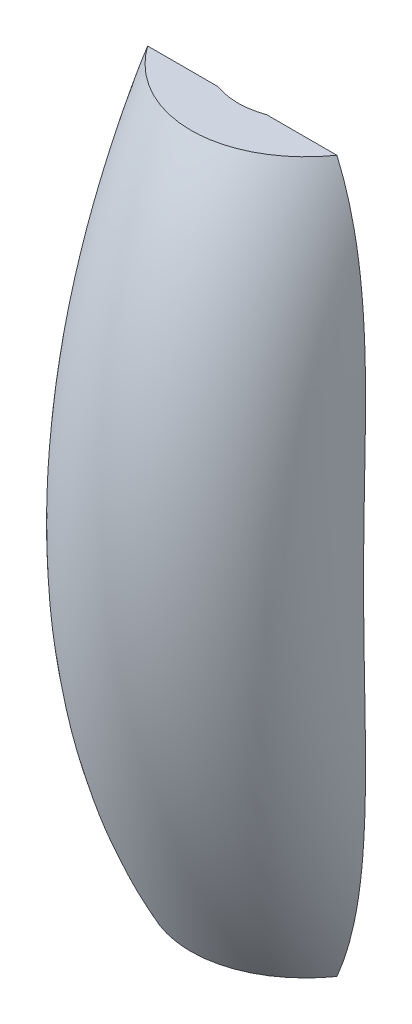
ISO-10303-21;
HEADER;
FILE_DESCRIPTION(('STEP AP214'),'2;1');
FILE_NAME('part.step','',(''),(''),'','','');
FILE_SCHEMA(('AUTOMOTIVE_DESIGN { 1 0 10303 214 1 1 1 1 }'));
ENDSEC;
DATA;
#1=APPLICATION_CONTEXT('core data for automotive mechanical design processes');
#2=APPLICATION_PROTOCOL_DEFINITION('international standard','automotive_design',2000,#1);
#3=PRODUCT_CONTEXT('',#1,'mechanical');
#4=PRODUCT('Part','Part','',(#3));
#5=PRODUCT_RELATED_PRODUCT_CATEGORY('part','',(#4));
#6=PRODUCT_DEFINITION_FORMATION('','',#4);
#7=PRODUCT_DEFINITION_CONTEXT('part definition',#1,'design');
#8=PRODUCT_DEFINITION('design','',#6,#7);
#9=PRODUCT_DEFINITION_SHAPE('','',#8);
#10=(LENGTH_UNIT() NAMED_UNIT(*) SI_UNIT(.MILLI.,.METRE.));
#11=(NAMED_UNIT(*) PLANE_ANGLE_UNIT() SI_UNIT($,.RADIAN.));
#12=(NAMED_UNIT(*) SI_UNIT($,.STERADIAN.) SOLID_ANGLE_UNIT());
#13=UNCERTAINTY_MEASURE_WITH_UNIT(LENGTH_MEASURE(1.E-05),#10,'distance_accuracy_value','');
#14=(GEOMETRIC_REPRESENTATION_CONTEXT(3) GLOBAL_UNCERTAINTY_ASSIGNED_CONTEXT((#13)) GLOBAL_UNIT_ASSIGNED_CONTEXT((#10,
#11,#12)) REPRESENTATION_CONTEXT('',''));
#15=CARTESIAN_POINT('',(0.,0.,0.));
#16=DIRECTION('',(0.,0.,1.));
#17=DIRECTION('',(1.,0.,0.));
#18=AXIS2_PLACEMENT_3D('',#15,#16,#17);
#19=CARTESIAN_POINT('',(0.,22.5,-133.));
#20=DIRECTION('',(1.,0.,0.));
#21=DIRECTION('',(0.,0.,-1.));
#22=AXIS2_PLACEMENT_3D('',#19,#20,#21);
#23=TOROIDAL_SURFACE('',#22,59.125,8.125);
#24=CARTESIAN_POINT('',(-2.39832928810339,-12.5,-76.));
#25=CARTESIAN_POINT('',(-2.53349893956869,-12.4201924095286,-76.));
#26=CARTESIAN_POINT('',(-2.6652676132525,-12.3348066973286,-76.));
#27=CARTESIAN_POINT('',(-2.92144714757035,-12.1545874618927,-76.));
#28=CARTESIAN_POINT('',(-3.04588402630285,-12.0597910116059,-76.));
#29=CARTESIAN_POINT('',(-3.2877487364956,-11.861932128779,-76.));
#30=CARTESIAN_POINT('',(-3.40518350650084,-11.7588781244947,-76.));
#31=CARTESIAN_POINT('',(-3.63171855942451,-11.5470693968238,-76.));
#32=CARTESIAN_POINT('',(-3.74091220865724,-11.4384141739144,-76.));
#33=CARTESIAN_POINT('',(-3.95304009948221,-11.2149861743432,-76.));
#34=CARTESIAN_POINT('',(-4.05596853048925,-11.1002078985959,-76.));
#35=CARTESIAN_POINT('',(-4.25575229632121,-10.8654179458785,-76.));
#36=CARTESIAN_POINT('',(-4.3526049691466,-10.7454040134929,-76.));
#37=CARTESIAN_POINT('',(-4.58534617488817,-10.4425136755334,-76.));
#38=CARTESIAN_POINT('',(-4.71779052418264,-10.2569851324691,-76.));
#39=CARTESIAN_POINT('',(-4.9708912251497,-9.87808621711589,-76.));
#40=CARTESIAN_POINT('',(-5.09154623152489,-9.68471495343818,-76.));
#41=CARTESIAN_POINT('',(-5.32200789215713,-9.29161483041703,-76.));
#42=CARTESIAN_POINT('',(-5.43181359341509,-9.09188541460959,-76.));
#43=CARTESIAN_POINT('',(-5.64214237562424,-8.68592338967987,-76.));
#44=CARTESIAN_POINT('',(-5.74259837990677,-8.47965619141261,-76.));
#45=CARTESIAN_POINT('',(-5.93420240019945,-8.06290696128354,-76.));
#46=CARTESIAN_POINT('',(-6.02535222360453,-7.85242575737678,-76.));
#47=CARTESIAN_POINT('',(-6.19911515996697,-7.42798367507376,-76.));
#48=CARTESIAN_POINT('',(-6.28172809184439,-7.21402272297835,-76.));
#49=CARTESIAN_POINT('',(-6.50667981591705,-6.59831422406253,-76.));
#50=CARTESIAN_POINT('',(-6.63940951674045,-6.19303750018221,-76.));
#51=CARTESIAN_POINT('',(-6.88170744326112,-5.3753306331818,-76.));
#52=CARTESIAN_POINT('',(-6.99125389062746,-4.96289415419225,-76.));
#53=CARTESIAN_POINT('',(-7.19034730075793,-4.13279433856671,-76.));
#54=CARTESIAN_POINT('',(-7.27987263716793,-3.7151258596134,-76.));
#55=CARTESIAN_POINT('',(-7.44149355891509,-2.87643605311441,-76.));
#56=CARTESIAN_POINT('',(-7.5135877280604,-2.4554144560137,-76.));
#57=CARTESIAN_POINT('',(-7.64314251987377,-1.60797814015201,-76.));
#58=CARTESIAN_POINT('',(-7.70049145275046,-1.18154653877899,-76.));
#59=CARTESIAN_POINT('',(-7.80188136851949,-0.327499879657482,-76.));
#60=CARTESIAN_POINT('',(-7.84593382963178,0.100113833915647,-76.));
#61=CARTESIAN_POINT('',(-7.92259723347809,0.956157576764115,-76.));
#62=CARTESIAN_POINT('',(-7.95521329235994,1.38458715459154,-76.));
#63=CARTESIAN_POINT('',(-8.01063643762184,2.24191132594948,-76.));
#64=CARTESIAN_POINT('',(-8.03344707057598,2.67080569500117,-76.));
#65=CARTESIAN_POINT('',(-8.07884913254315,3.71549719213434,-76.));
#66=CARTESIAN_POINT('',(-8.09703363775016,4.33148376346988,-76.));
#67=CARTESIAN_POINT('',(-8.12012292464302,5.56371913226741,-76.));
#68=CARTESIAN_POINT('',(-8.12502668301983,6.17996794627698,-76.));
#69=CARTESIAN_POINT('',(-8.12497310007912,7.41247575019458,-76.));
#70=CARTESIAN_POINT('',(-8.12001534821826,8.02873473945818,-76.));
#71=CARTESIAN_POINT('',(-8.10331848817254,9.261134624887,-76.));
#72=CARTESIAN_POINT('',(-8.09157954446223,9.87727552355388,-76.));
#73=CARTESIAN_POINT('',(-8.06408237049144,11.1100103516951,-76.));
#74=CARTESIAN_POINT('',(-8.04832057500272,11.7266041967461,-76.));
#75=CARTESIAN_POINT('',(-8.01526904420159,12.9597517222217,-76.));
#76=CARTESIAN_POINT('',(-7.99797930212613,13.5763054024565,-76.));
#77=CARTESIAN_POINT('',(-7.96403085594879,14.8100263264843,-76.));
#78=CARTESIAN_POINT('',(-7.94737277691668,15.4271935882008,-76.));
#79=CARTESIAN_POINT('',(-7.91653942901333,16.6615902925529,-76.));
#80=CARTESIAN_POINT('',(-7.90236415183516,17.2788197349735,-76.));
#81=CARTESIAN_POINT('',(-7.87792116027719,18.5140519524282,-76.));
#82=CARTESIAN_POINT('',(-7.86765785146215,19.1320548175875,-76.));
#83=CARTESIAN_POINT('',(-7.85205691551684,20.3681242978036,-76.));
#84=CARTESIAN_POINT('',(-7.84671928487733,20.9861909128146,-76.));
#85=CARTESIAN_POINT('',(-7.84147094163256,22.2233103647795,-76.));
#86=CARTESIAN_POINT('',(-7.84156869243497,22.842363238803,-76.));
#87=CARTESIAN_POINT('',(-7.84720311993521,24.0804435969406,-76.));
#88=CARTESIAN_POINT('',(-7.85273979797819,24.6994710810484,-76.));
#89=CARTESIAN_POINT('',(-7.86864943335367,25.9315664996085,-76.));
#90=CARTESIAN_POINT('',(-7.87897583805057,26.5446350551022,-76.));
#91=CARTESIAN_POINT('',(-7.90346041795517,27.7706943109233,-76.));
#92=CARTESIAN_POINT('',(-7.91761860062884,28.3836850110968,-76.));
#93=CARTESIAN_POINT('',(-7.94835396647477,29.6098702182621,-76.));
#94=CARTESIAN_POINT('',(-7.964932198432,30.2230646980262,-76.));
#95=CARTESIAN_POINT('',(-7.99869734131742,31.4494362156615,-76.));
#96=CARTESIAN_POINT('',(-8.01588425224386,32.0626132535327,-76.));
#97=CARTESIAN_POINT('',(-8.04869995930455,33.2881561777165,-76.));
#98=CARTESIAN_POINT('',(-8.06433089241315,33.9005220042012,-76.));
#99=CARTESIAN_POINT('',(-8.09162443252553,35.1253523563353,-76.));
#100=CARTESIAN_POINT('',(-8.1032870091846,35.7378168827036,-76.));
#101=CARTESIAN_POINT('',(-8.11989302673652,36.9609752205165,-76.));
#102=CARTESIAN_POINT('',(-8.12485689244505,37.57166872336,-76.));
#103=CARTESIAN_POINT('',(-8.1251370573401,38.7930625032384,-76.));
#104=CARTESIAN_POINT('',(-8.12045355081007,39.4037627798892,-76.));
#105=CARTESIAN_POINT('',(-8.09815147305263,40.6227871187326,-76.));
#106=CARTESIAN_POINT('',(-8.08057877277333,41.2311119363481,-76.));
#107=CARTESIAN_POINT('',(-8.0288548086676,42.447151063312,-76.));
#108=CARTESIAN_POINT('',(-7.99470203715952,43.0548653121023,-76.));
#109=CARTESIAN_POINT('',(-7.90563283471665,44.2684393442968,-76.));
#110=CARTESIAN_POINT('',(-7.85072900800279,44.8743000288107,-75.9999999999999));
#111=CARTESIAN_POINT('',(-7.71528639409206,46.0830982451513,-76.0000000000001));
#112=CARTESIAN_POINT('',(-7.63475495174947,46.6860365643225,-76.0000000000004));
#113=CARTESIAN_POINT('',(-7.49717639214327,47.5440344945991,-76.0000000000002));
#114=CARTESIAN_POINT('',(-7.45297105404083,47.8011762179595,-76.0000000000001));
#115=CARTESIAN_POINT('',(-7.35818615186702,48.3144610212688,-75.9999999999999));
#116=CARTESIAN_POINT('',(-7.30760253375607,48.570603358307,-76.));
#117=CARTESIAN_POINT('',(-7.19949113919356,49.0814837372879,-76.));
#118=CARTESIAN_POINT('',(-7.14196179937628,49.3362214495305,-76.));
#119=CARTESIAN_POINT('',(-7.01906470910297,49.8449387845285,-76.));
#120=CARTESIAN_POINT('',(-6.95366507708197,50.0989107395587,-76.));
#121=CARTESIAN_POINT('',(-6.81450790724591,50.6045246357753,-76.));
#122=CARTESIAN_POINT('',(-6.74075158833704,50.8561669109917,-76.));
#123=CARTESIAN_POINT('',(-6.58407212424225,51.3565795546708,-76.));
#124=CARTESIAN_POINT('',(-6.50114945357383,51.6053500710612,-76.));
#125=CARTESIAN_POINT('',(-6.32381348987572,52.1033133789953,-76.));
#126=CARTESIAN_POINT('',(-6.22923620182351,52.3524480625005,-76.));
#127=CARTESIAN_POINT('',(-6.02861562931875,52.8461148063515,-76.));
#128=CARTESIAN_POINT('',(-5.92257102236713,53.0906463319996,-76.));
#129=CARTESIAN_POINT('',(-5.69777352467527,53.5740074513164,-76.));
#130=CARTESIAN_POINT('',(-5.57901306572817,53.8128335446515,-76.));
#131=CARTESIAN_POINT('',(-5.32874686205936,54.2807522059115,-76.));
#132=CARTESIAN_POINT('',(-5.19737751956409,54.5099172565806,-76.));
#133=CARTESIAN_POINT('',(-4.91960412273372,54.9588516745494,-76.));
#134=CARTESIAN_POINT('',(-4.77320693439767,55.1786252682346,-76.));
#135=CARTESIAN_POINT('',(-4.46396268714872,55.6061027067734,-76.));
#136=CARTESIAN_POINT('',(-4.30113223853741,55.8138184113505,-76.));
#137=CARTESIAN_POINT('',(-4.04689967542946,56.109820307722,-76.));
#138=CARTESIAN_POINT('',(-3.96237339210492,56.2040541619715,-76.));
#139=CARTESIAN_POINT('',(-3.78906705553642,56.3884820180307,-76.));
#140=CARTESIAN_POINT('',(-3.70028850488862,56.4786774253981,-76.));
#141=CARTESIAN_POINT('',(-3.51839357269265,56.6544784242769,-76.));
#142=CARTESIAN_POINT('',(-3.4252798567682,56.740086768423,-76.));
#143=CARTESIAN_POINT('',(-3.23343929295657,56.9071779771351,-76.));
#144=CARTESIAN_POINT('',(-3.13465858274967,56.9885991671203,-76.));
#145=CARTESIAN_POINT('',(-2.93241151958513,57.1455734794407,-76.));
#146=CARTESIAN_POINT('',(-2.8289419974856,57.221122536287,-76.));
#147=CARTESIAN_POINT('',(-2.61718541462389,57.3657065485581,-76.));
#148=CARTESIAN_POINT('',(-2.50888724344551,57.434725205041,-76.));
#149=CARTESIAN_POINT('',(-2.39832928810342,57.5,-76.));
#150=B_SPLINE_CURVE_WITH_KNOTS('',3,(#24,#25,#26,#27,#28,#29,#30,#31,#32,#33,#34,#35,#36,#37,
#38,#39,#40,#41,#42,#43,#44,#45,#46,#47,#48,#49,#50,#51,#52,#53,#54,#55,#56,#57,#58,#59,#60,#61,
#62,#63,#64,#65,#66,#67,#68,#69,#70,#71,#72,#73,#74,#75,#76,#77,#78,#79,#80,#81,#82,#83,#84,#85,
#86,#87,#88,#89,#90,#91,#92,#93,#94,#95,#96,#97,#98,#99,#100,#101,#102,#103,#104,#105,#106,#107,
#108,#109,#110,#111,#112,#113,#114,#115,#116,#117,#118,#119,#120,#121,#122,#123,#124,#125,#126,
#127,#128,#129,#130,#131,#132,#133,#134,#135,#136,#137,#138,#139,#140,#141,#142,#143,#144,#145,
#146,#147,#148,#149),.UNSPECIFIED.,.F.,.F.,(4,2,2,2,2,2,2,2,2,2,2,2,2,2,2,2,2,2,2,2,2,2,2,2,2,2,
2,2,2,2,2,2,2,2,2,2,2,2,2,2,2,2,2,2,2,2,2,2,2,2,2,2,2,2,2,2,2,2,2,2,2,2,4),(0.,
0.470644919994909,0.939504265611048,1.40789101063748,1.86974808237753,2.33202716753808,
2.79450739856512,3.47782879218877,4.16122806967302,4.8446873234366,5.53272282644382,
6.22062444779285,6.90854065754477,8.18700087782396,9.46665680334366,10.747688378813,
12.0288239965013,13.3193954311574,14.608849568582,15.8977261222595,17.1861361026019,
19.0346979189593,20.8834021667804,22.7321833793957,24.580919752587,26.4313002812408,
28.2816890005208,30.1338633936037,31.9860315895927,33.8402795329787,35.6945261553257,
37.5516600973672,39.4087944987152,41.248245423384,43.0876999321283,44.9279539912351,
46.7682080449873,48.6058987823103,50.4436035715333,52.2756923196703,54.1077441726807,
55.9333074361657,57.7590367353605,59.5836588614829,61.4077585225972,62.1904364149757,
62.9736143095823,63.7569688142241,64.5436107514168,65.3301380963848,66.116624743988,
66.915817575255,67.7151026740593,68.5148661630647,69.3067870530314,70.0983477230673,
70.8891161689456,71.2687721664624,71.6482949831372,72.027587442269,72.4114216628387,
72.7955193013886,73.1805516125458),.UNSPECIFIED.);
#151=CARTESIAN_POINT('',(-2.39832928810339,-12.5,-76.));
#152=VERTEX_POINT('',#151);
#153=CARTESIAN_POINT('',(-2.39832928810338,57.5,-76.));
#154=VERTEX_POINT('',#153);
#155=EDGE_CURVE('E21',#152,#154,#150,.T.);
#156=ORIENTED_EDGE('',*,*,#155,.T.);
#157=CARTESIAN_POINT('',(0.,57.5,-75.5755931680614));
#158=CARTESIAN_POINT('',(-0.0821959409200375,57.5,-75.5755920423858));
#159=CARTESIAN_POINT('',(-0.16439169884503,57.5,-75.5770538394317));
#160=CARTESIAN_POINT('',(-0.328279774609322,57.5,-75.5828809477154));
#161=CARTESIAN_POINT('',(-0.409972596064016,57.5,-75.5872320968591));
#162=CARTESIAN_POINT('',(-0.572858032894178,57.5,-75.5987948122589));
#163=CARTESIAN_POINT('',(-0.654051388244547,57.5,-75.6059959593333));
#164=CARTESIAN_POINT('',(-0.815940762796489,57.5,-75.6232225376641));
#165=CARTESIAN_POINT('',(-0.89663750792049,57.5,-75.6332411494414));
#166=CARTESIAN_POINT('',(-1.05753601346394,57.5,-75.6560752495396));
#167=CARTESIAN_POINT('',(-1.13773824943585,57.5,-75.6688873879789));
#168=CARTESIAN_POINT('',(-1.29764256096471,57.5,-75.6972877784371));
#169=CARTESIAN_POINT('',(-1.3773446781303,57.5,-75.7128757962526));
#170=CARTESIAN_POINT('',(-1.53626144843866,57.5,-75.7468180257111));
#171=CARTESIAN_POINT('',(-1.61547536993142,57.5,-75.7651756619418));
#172=CARTESIAN_POINT('',(-1.77341674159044,57.5,-75.8046537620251));
#173=CARTESIAN_POINT('',(-1.85214253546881,57.5,-75.8257808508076));
#174=CARTESIAN_POINT('',(-2.00910659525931,57.5,-75.8708023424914));
#175=CARTESIAN_POINT('',(-2.0873420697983,57.5,-75.8947064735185));
#176=CARTESIAN_POINT('',(-2.24332363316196,57.5,-75.9452928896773));
#177=CARTESIAN_POINT('',(-2.32106558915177,57.5,-75.9719879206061));
#178=CARTESIAN_POINT('',(-2.39832928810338,57.5,-76.));
#179=B_SPLINE_CURVE_WITH_KNOTS('',3,(#157,#158,#159,#160,#161,#162,#163,#164,#165,#166,#167,
#168,#169,#170,#171,#172,#173,#174,#175,#176,#177,#178),.UNSPECIFIED.,.F.,.F.,(4,2,2,2,2,2,2,2,
2,2,4),(0.,0.246574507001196,0.491949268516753,0.736435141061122,0.980334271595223,
1.22394252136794,1.46753022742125,1.71142163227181,1.95590748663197,2.20127719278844,
2.44782095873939),.UNSPECIFIED.);
#180=CARTESIAN_POINT('',(0.,57.5,-75.5755931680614));
#181=VERTEX_POINT('',#180);
#182=EDGE_CURVE('E126',#181,#154,#179,.T.);
#183=ORIENTED_EDGE('',*,*,#182,.F.);
#184=CARTESIAN_POINT('',(2.39832928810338,57.5,-76.));
#185=CARTESIAN_POINT('',(2.32106558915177,57.5,-75.9719879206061));
#186=CARTESIAN_POINT('',(2.24332363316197,57.5,-75.9452928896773));
#187=CARTESIAN_POINT('',(2.08734206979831,57.5,-75.8947064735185));
#188=CARTESIAN_POINT('',(2.00910659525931,57.5,-75.8708023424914));
#189=CARTESIAN_POINT('',(1.85214253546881,57.5,-75.8257808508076));
#190=CARTESIAN_POINT('',(1.77341674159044,57.5,-75.8046537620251));
#191=CARTESIAN_POINT('',(1.61547536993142,57.5,-75.7651756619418));
#192=CARTESIAN_POINT('',(1.53626144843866,57.5,-75.7468180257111));
#193=CARTESIAN_POINT('',(1.3773446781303,57.5,-75.7128757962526));
#194=CARTESIAN_POINT('',(1.29764256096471,57.5,-75.6972877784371));
#195=CARTESIAN_POINT('',(1.13773824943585,57.5,-75.6688873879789));
#196=CARTESIAN_POINT('',(1.05753601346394,57.5,-75.6560752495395));
#197=CARTESIAN_POINT('',(0.896637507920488,57.5,-75.6332411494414));
#198=CARTESIAN_POINT('',(0.815940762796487,57.5,-75.623222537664));
#199=CARTESIAN_POINT('',(0.654051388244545,57.5,-75.6059959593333));
#200=CARTESIAN_POINT('',(0.572858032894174,57.5,-75.5987948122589));
#201=CARTESIAN_POINT('',(0.409972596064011,57.5,-75.5872320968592));
#202=CARTESIAN_POINT('',(0.328279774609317,57.5,-75.5828809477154));
#203=CARTESIAN_POINT('',(0.164391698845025,57.5,-75.5770538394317));
#204=CARTESIAN_POINT('',(0.0821959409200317,57.5,-75.5755920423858));
#205=CARTESIAN_POINT('',(0.,57.5,-75.5755931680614));
#206=B_SPLINE_CURVE_WITH_KNOTS('',3,(#184,#185,#186,#187,#188,#189,#190,#191,#192,#193,#194,
#195,#196,#197,#198,#199,#200,#201,#202,#203,#204,#205),.UNSPECIFIED.,.F.,.F.,(4,2,2,2,2,2,2,2,
2,2,4),(0.,0.246543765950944,0.49191347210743,0.736399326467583,0.980290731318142,
1.22387843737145,1.46748668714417,1.71138581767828,1.95587169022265,2.2012464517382,
2.4478209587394),.UNSPECIFIED.);
#207=CARTESIAN_POINT('',(2.39832928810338,57.5,-76.));
#208=VERTEX_POINT('',#207);
#209=EDGE_CURVE('E177',#208,#181,#206,.T.);
#210=ORIENTED_EDGE('',*,*,#209,.F.);
#211=CARTESIAN_POINT('',(2.39832928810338,57.5,-76.));
#212=CARTESIAN_POINT('',(2.5334989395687,57.4201924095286,-76.));
#213=CARTESIAN_POINT('',(2.6652676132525,57.3348066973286,-76.));
#214=CARTESIAN_POINT('',(2.92144714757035,57.1545874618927,-76.));
#215=CARTESIAN_POINT('',(3.04588402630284,57.0597910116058,-76.));
#216=CARTESIAN_POINT('',(3.28774873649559,56.861932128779,-76.));
#217=CARTESIAN_POINT('',(3.40518350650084,56.7588781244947,-76.));
#218=CARTESIAN_POINT('',(3.63171855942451,56.5470693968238,-76.));
#219=CARTESIAN_POINT('',(3.74091220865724,56.4384141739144,-76.));
#220=CARTESIAN_POINT('',(3.95304009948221,56.2149861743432,-76.));
#221=CARTESIAN_POINT('',(4.05596853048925,56.1002078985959,-76.));
#222=CARTESIAN_POINT('',(4.2557522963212,55.8654179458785,-76.));
#223=CARTESIAN_POINT('',(4.35260496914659,55.7454040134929,-76.));
#224=CARTESIAN_POINT('',(4.58534617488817,55.4425136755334,-76.));
#225=CARTESIAN_POINT('',(4.71779052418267,55.2569851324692,-76.));
#226=CARTESIAN_POINT('',(4.97089122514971,54.8780862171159,-76.));
#227=CARTESIAN_POINT('',(5.09154623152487,54.6847149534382,-76.));
#228=CARTESIAN_POINT('',(5.32200789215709,54.291614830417,-76.));
#229=CARTESIAN_POINT('',(5.43181359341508,54.0918854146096,-76.));
#230=CARTESIAN_POINT('',(5.64214237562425,53.6859233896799,-76.));
#231=CARTESIAN_POINT('',(5.74259837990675,53.4796561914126,-76.));
#232=CARTESIAN_POINT('',(5.93420240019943,53.0629069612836,-76.));
#233=CARTESIAN_POINT('',(6.02535222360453,52.8524257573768,-76.));
#234=CARTESIAN_POINT('',(6.19911515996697,52.4279836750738,-76.));
#235=CARTESIAN_POINT('',(6.28172809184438,52.2140227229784,-76.));
#236=CARTESIAN_POINT('',(6.50667981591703,51.5983142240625,-76.));
#237=CARTESIAN_POINT('',(6.63940951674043,51.1930375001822,-76.));
#238=CARTESIAN_POINT('',(6.88170744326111,50.3753306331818,-76.));
#239=CARTESIAN_POINT('',(6.99125389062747,49.9628941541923,-76.));
#240=CARTESIAN_POINT('',(7.19034730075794,49.1327943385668,-76.));
#241=CARTESIAN_POINT('',(7.27987263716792,48.7151258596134,-76.));
#242=CARTESIAN_POINT('',(7.44149355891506,47.8764360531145,-76.));
#243=CARTESIAN_POINT('',(7.51358772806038,47.4554144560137,-76.));
#244=CARTESIAN_POINT('',(7.64314251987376,46.6079781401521,-76.));
#245=CARTESIAN_POINT('',(7.70049145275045,46.181546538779,-76.));
#246=CARTESIAN_POINT('',(7.80188136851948,45.3274998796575,-76.));
#247=CARTESIAN_POINT('',(7.84593382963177,44.8998861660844,-76.));
#248=CARTESIAN_POINT('',(7.92259723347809,44.0438424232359,-76.));
#249=CARTESIAN_POINT('',(7.95521329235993,43.6154128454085,-76.));
#250=CARTESIAN_POINT('',(8.01063643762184,42.7580886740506,-76.));
#251=CARTESIAN_POINT('',(8.03344707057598,42.3291943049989,-76.));
#252=CARTESIAN_POINT('',(8.07884913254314,41.2845028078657,-76.));
#253=CARTESIAN_POINT('',(8.09703363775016,40.6685162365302,-76.));
#254=CARTESIAN_POINT('',(8.12012292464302,39.4362808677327,-76.));
#255=CARTESIAN_POINT('',(8.12502668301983,38.8200320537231,-76.));
#256=CARTESIAN_POINT('',(8.12497310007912,37.5875242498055,-76.));
#257=CARTESIAN_POINT('',(8.12001534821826,36.9712652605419,-76.));
#258=CARTESIAN_POINT('',(8.10331848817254,35.7388653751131,-76.));
#259=CARTESIAN_POINT('',(8.09157954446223,35.1227244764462,-76.));
#260=CARTESIAN_POINT('',(8.06408237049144,33.889989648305,-76.));
#261=CARTESIAN_POINT('',(8.04832057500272,33.2733958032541,-76.));
#262=CARTESIAN_POINT('',(8.0152690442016,32.0402482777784,-76.));
#263=CARTESIAN_POINT('',(7.99797930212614,31.4236945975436,-76.));
#264=CARTESIAN_POINT('',(7.9640308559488,30.1899736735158,-76.));
#265=CARTESIAN_POINT('',(7.94737277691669,29.5728064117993,-76.));
#266=CARTESIAN_POINT('',(7.91653942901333,28.3384097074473,-76.));
#267=CARTESIAN_POINT('',(7.90236415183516,27.7211802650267,-76.));
#268=CARTESIAN_POINT('',(7.8779211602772,26.4859480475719,-76.));
#269=CARTESIAN_POINT('',(7.86765785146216,25.8679451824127,-76.));
#270=CARTESIAN_POINT('',(7.85205691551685,24.6318757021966,-76.));
#271=CARTESIAN_POINT('',(7.84671928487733,24.0138090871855,-76.));
#272=CARTESIAN_POINT('',(7.84147094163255,22.7766896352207,-76.));
#273=CARTESIAN_POINT('',(7.84156869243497,22.1576367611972,-76.));
#274=CARTESIAN_POINT('',(7.84720311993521,20.9195564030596,-76.));
#275=CARTESIAN_POINT('',(7.8527397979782,20.3005289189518,-76.));
#276=CARTESIAN_POINT('',(7.86864943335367,19.0684335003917,-76.));
#277=CARTESIAN_POINT('',(7.87897583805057,18.4553649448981,-76.));
#278=CARTESIAN_POINT('',(7.90346041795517,17.2293056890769,-76.));
#279=CARTESIAN_POINT('',(7.91761860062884,16.6163149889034,-76.));
#280=CARTESIAN_POINT('',(7.94835396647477,15.3901297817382,-76.));
#281=CARTESIAN_POINT('',(7.96493219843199,14.776935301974,-76.));
#282=CARTESIAN_POINT('',(7.99869734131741,13.5505637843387,-76.));
#283=CARTESIAN_POINT('',(8.01588425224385,12.9373867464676,-76.));
#284=CARTESIAN_POINT('',(8.04869995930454,11.7118438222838,-76.));
#285=CARTESIAN_POINT('',(8.06433089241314,11.0994779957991,-76.));
#286=CARTESIAN_POINT('',(8.09162443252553,9.87464764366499,-76.));
#287=CARTESIAN_POINT('',(8.10328700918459,9.26218311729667,-76.));
#288=CARTESIAN_POINT('',(8.11989302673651,8.03902477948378,-76.));
#289=CARTESIAN_POINT('',(8.12485689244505,7.42833127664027,-76.));
#290=CARTESIAN_POINT('',(8.1251370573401,6.20693749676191,-76.));
#291=CARTESIAN_POINT('',(8.12045355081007,5.59623722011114,-76.));
#292=CARTESIAN_POINT('',(8.09815147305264,4.37721288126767,-76.));
#293=CARTESIAN_POINT('',(8.08057877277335,3.76888806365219,-76.));
#294=CARTESIAN_POINT('',(8.02885480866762,2.55284893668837,-76.));
#295=CARTESIAN_POINT('',(7.99470203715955,1.94513468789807,-76.));
#296=CARTESIAN_POINT('',(7.90563283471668,0.731560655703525,-76.));
#297=CARTESIAN_POINT('',(7.85072900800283,0.125699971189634,-75.9999999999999));
#298=CARTESIAN_POINT('',(7.71528639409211,-1.08309824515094,-76.0000000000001));
#299=CARTESIAN_POINT('',(7.63475495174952,-1.68603656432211,-76.0000000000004));
#300=CARTESIAN_POINT('',(7.49717639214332,-2.54403449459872,-76.0000000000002));
#301=CARTESIAN_POINT('',(7.45297105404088,-2.80117621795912,-76.0000000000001));
#302=CARTESIAN_POINT('',(7.35818615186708,-3.31446102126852,-75.9999999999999));
#303=CARTESIAN_POINT('',(7.30760253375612,-3.57060335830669,-76.));
#304=CARTESIAN_POINT('',(7.19949113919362,-4.08148373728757,-76.));
#305=CARTESIAN_POINT('',(7.14196179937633,-4.3362214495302,-76.));
#306=CARTESIAN_POINT('',(7.01906470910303,-4.84493878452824,-76.));
#307=CARTESIAN_POINT('',(6.95366507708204,-5.09891073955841,-76.));
#308=CARTESIAN_POINT('',(6.81450790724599,-5.60452463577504,-76.));
#309=CARTESIAN_POINT('',(6.74075158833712,-5.85616691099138,-76.));
#310=CARTESIAN_POINT('',(6.58407212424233,-6.35657955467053,-76.));
#311=CARTESIAN_POINT('',(6.50114945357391,-6.60535007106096,-76.));
#312=CARTESIAN_POINT('',(6.32381348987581,-7.10331337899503,-76.));
#313=CARTESIAN_POINT('',(6.22923620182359,-7.35244806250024,-76.));
#314=CARTESIAN_POINT('',(6.02861562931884,-7.84611480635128,-76.));
#315=CARTESIAN_POINT('',(5.92257102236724,-8.0906463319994,-76.));
#316=CARTESIAN_POINT('',(5.69777352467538,-8.5740074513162,-76.));
#317=CARTESIAN_POINT('',(5.57901306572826,-8.81283354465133,-76.));
#318=CARTESIAN_POINT('',(5.32874686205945,-9.28075220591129,-76.));
#319=CARTESIAN_POINT('',(5.19737751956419,-9.50991725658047,-76.));
#320=CARTESIAN_POINT('',(4.91960412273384,-9.95885167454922,-76.));
#321=CARTESIAN_POINT('',(4.77320693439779,-10.1786252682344,-76.));
#322=CARTESIAN_POINT('',(4.46396268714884,-10.6061027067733,-76.));
#323=CARTESIAN_POINT('',(4.30113223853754,-10.8138184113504,-76.));
#324=CARTESIAN_POINT('',(4.04689967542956,-11.1098203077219,-76.));
#325=CARTESIAN_POINT('',(3.962373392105,-11.2040541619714,-76.));
#326=CARTESIAN_POINT('',(3.78906705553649,-11.3884820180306,-76.));
#327=CARTESIAN_POINT('',(3.70028850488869,-11.478677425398,-76.));
#328=CARTESIAN_POINT('',(3.51839357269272,-11.6544784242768,-76.));
#329=CARTESIAN_POINT('',(3.42527985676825,-11.7400867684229,-76.));
#330=CARTESIAN_POINT('',(3.23343929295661,-11.9071779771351,-76.));
#331=CARTESIAN_POINT('',(3.13465858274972,-11.9885991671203,-76.));
#332=CARTESIAN_POINT('',(2.93241151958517,-12.1455734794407,-76.));
#333=CARTESIAN_POINT('',(2.82894199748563,-12.221122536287,-76.));
#334=CARTESIAN_POINT('',(2.61718541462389,-12.3657065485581,-76.));
#335=CARTESIAN_POINT('',(2.50888724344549,-12.4347252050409,-76.));
#336=CARTESIAN_POINT('',(2.3983292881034,-12.5,-76.));
#337=B_SPLINE_CURVE_WITH_KNOTS('',3,(#211,#212,#213,#214,#215,#216,#217,#218,#219,#220,#221,
#222,#223,#224,#225,#226,#227,#228,#229,#230,#231,#232,#233,#234,#235,#236,#237,#238,#239,#240,
#241,#242,#243,#244,#245,#246,#247,#248,#249,#250,#251,#252,#253,#254,#255,#256,#257,#258,#259,
#260,#261,#262,#263,#264,#265,#266,#267,#268,#269,#270,#271,#272,#273,#274,#275,#276,#277,#278,
#279,#280,#281,#282,#283,#284,#285,#286,#287,#288,#289,#290,#291,#292,#293,#294,#295,#296,#297,
#298,#299,#300,#301,#302,#303,#304,#305,#306,#307,#308,#309,#310,#311,#312,#313,#314,#315,#316,
#317,#318,#319,#320,#321,#322,#323,#324,#325,#326,#327,#328,#329,#330,#331,#332,#333,#334,#335,
#336),.UNSPECIFIED.,.F.,.F.,(4,2,2,2,2,2,2,2,2,2,2,2,2,2,2,2,2,2,2,2,2,2,2,2,2,2,2,2,2,2,2,2,2,
2,2,2,2,2,2,2,2,2,2,2,2,2,2,2,2,2,2,2,2,2,2,2,2,2,2,2,2,2,4),(0.,0.470644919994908,
0.93950426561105,1.40789101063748,1.86974808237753,2.33202716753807,2.7945073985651,
3.47782879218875,4.16122806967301,4.84468732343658,5.53272282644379,6.22062444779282,
6.90854065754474,8.18700087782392,9.46665680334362,10.7476883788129,12.0288239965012,
13.3193954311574,14.6088495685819,15.8977261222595,17.1861361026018,19.0346979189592,
20.8834021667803,22.7321833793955,24.5809197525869,26.4313002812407,28.2816890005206,
30.1338633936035,31.9860315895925,33.8402795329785,35.6945261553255,37.551660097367,
39.408794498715,41.2482454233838,43.087699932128,44.9279539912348,46.768208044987,
48.60589878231,50.443603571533,52.27569231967,54.1077441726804,55.9333074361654,
57.7590367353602,59.5836588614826,61.4077585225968,62.1904364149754,62.973614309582,
63.7569688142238,64.5436107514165,65.3301380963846,66.1166247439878,66.9158175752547,
67.7151026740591,68.5148661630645,69.3067870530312,70.0983477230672,70.8891161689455,
71.2687721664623,71.6482949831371,72.027587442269,72.4114216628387,72.7955193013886,
73.1805516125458),.UNSPECIFIED.);
#338=CARTESIAN_POINT('',(2.39832928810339,-12.5,-76.));
#339=VERTEX_POINT('',#338);
#340=EDGE_CURVE('E97',#208,#339,#337,.T.);
#341=ORIENTED_EDGE('',*,*,#340,.T.);
#342=CARTESIAN_POINT('',(0.,-12.5,-75.5755931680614));
#343=CARTESIAN_POINT('',(0.0821959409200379,-12.5,-75.5755920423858));
#344=CARTESIAN_POINT('',(0.16439169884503,-12.5,-75.5770538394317));
#345=CARTESIAN_POINT('',(0.328279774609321,-12.5,-75.5828809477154));
#346=CARTESIAN_POINT('',(0.409972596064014,-12.5,-75.5872320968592));
#347=CARTESIAN_POINT('',(0.572858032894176,-12.5,-75.5987948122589));
#348=CARTESIAN_POINT('',(0.654051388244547,-12.5,-75.6059959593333));
#349=CARTESIAN_POINT('',(0.81594076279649,-12.5,-75.623222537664));
#350=CARTESIAN_POINT('',(0.896637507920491,-12.5,-75.6332411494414));
#351=CARTESIAN_POINT('',(1.05753601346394,-12.5,-75.6560752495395));
#352=CARTESIAN_POINT('',(1.13773824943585,-12.5,-75.6688873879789));
#353=CARTESIAN_POINT('',(1.29764256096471,-12.5,-75.6972877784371));
#354=CARTESIAN_POINT('',(1.37734467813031,-12.5,-75.7128757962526));
#355=CARTESIAN_POINT('',(1.53626144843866,-12.5,-75.7468180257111));
#356=CARTESIAN_POINT('',(1.61547536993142,-12.5,-75.7651756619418));
#357=CARTESIAN_POINT('',(1.77341674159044,-12.5,-75.8046537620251));
#358=CARTESIAN_POINT('',(1.85214253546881,-12.5,-75.8257808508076));
#359=CARTESIAN_POINT('',(2.00910659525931,-12.5,-75.8708023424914));
#360=CARTESIAN_POINT('',(2.0873420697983,-12.5,-75.8947064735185));
#361=CARTESIAN_POINT('',(2.24332363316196,-12.5,-75.9452928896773));
#362=CARTESIAN_POINT('',(2.32106558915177,-12.5,-75.9719879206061));
#363=CARTESIAN_POINT('',(2.39832928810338,-12.5,-76.));
#364=B_SPLINE_CURVE_WITH_KNOTS('',3,(#342,#343,#344,#345,#346,#347,#348,#349,#350,#351,#352,
#353,#354,#355,#356,#357,#358,#359,#360,#361,#362,#363),.UNSPECIFIED.,.F.,.F.,(4,2,2,2,2,2,2,2,
2,2,4),(0.,0.246574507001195,0.491949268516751,0.736435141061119,0.980334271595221,
1.22394252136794,1.46753022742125,1.71142163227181,1.95590748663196,2.20127719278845,
2.44782095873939),.UNSPECIFIED.);
#365=CARTESIAN_POINT('',(0.,-12.5,-75.5755931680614));
#366=VERTEX_POINT('',#365);
#367=EDGE_CURVE('E81',#366,#339,#364,.T.);
#368=ORIENTED_EDGE('',*,*,#367,.F.);
#369=CARTESIAN_POINT('',(-2.39832928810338,-12.5,-76.));
#370=CARTESIAN_POINT('',(-2.32106558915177,-12.5,-75.9719879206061));
#371=CARTESIAN_POINT('',(-2.24332363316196,-12.5,-75.9452928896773));
#372=CARTESIAN_POINT('',(-2.0873420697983,-12.5,-75.8947064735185));
#373=CARTESIAN_POINT('',(-2.00910659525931,-12.5,-75.8708023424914));
#374=CARTESIAN_POINT('',(-1.85214253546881,-12.5,-75.8257808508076));
#375=CARTESIAN_POINT('',(-1.77341674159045,-12.5,-75.8046537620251));
#376=CARTESIAN_POINT('',(-1.61547536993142,-12.5,-75.7651756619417));
#377=CARTESIAN_POINT('',(-1.53626144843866,-12.5,-75.7468180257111));
#378=CARTESIAN_POINT('',(-1.37734467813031,-12.5,-75.7128757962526));
#379=CARTESIAN_POINT('',(-1.29764256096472,-12.5,-75.6972877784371));
#380=CARTESIAN_POINT('',(-1.13773824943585,-12.5,-75.6688873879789));
#381=CARTESIAN_POINT('',(-1.05753601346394,-12.5,-75.6560752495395));
#382=CARTESIAN_POINT('',(-0.896637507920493,-12.5,-75.6332411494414));
#383=CARTESIAN_POINT('',(-0.815940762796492,-12.5,-75.623222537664));
#384=CARTESIAN_POINT('',(-0.65405138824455,-12.5,-75.6059959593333));
#385=CARTESIAN_POINT('',(-0.57285803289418,-12.5,-75.5987948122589));
#386=CARTESIAN_POINT('',(-0.409972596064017,-12.5,-75.5872320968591));
#387=CARTESIAN_POINT('',(-0.328279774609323,-12.5,-75.5828809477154));
#388=CARTESIAN_POINT('',(-0.16439169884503,-12.5,-75.5770538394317));
#389=CARTESIAN_POINT('',(-0.0821959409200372,-12.5,-75.5755920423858));
#390=CARTESIAN_POINT('',(0.,-12.5,-75.5755931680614));
#391=B_SPLINE_CURVE_WITH_KNOTS('',3,(#369,#370,#371,#372,#373,#374,#375,#376,#377,#378,#379,
#380,#381,#382,#383,#384,#385,#386,#387,#388,#389,#390),.UNSPECIFIED.,.F.,.F.,(4,2,2,2,2,2,2,2,
2,2,4),(0.,0.246543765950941,0.491913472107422,0.736399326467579,0.980290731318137,
1.22387843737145,1.46748668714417,1.71138581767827,1.95587169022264,2.2012464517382,
2.44782095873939),.UNSPECIFIED.);
#392=EDGE_CURVE('E77',#152,#366,#391,.T.);
#393=ORIENTED_EDGE('',*,*,#392,.F.);
#394=EDGE_LOOP('',(#156,#183,#210,#341,#368,#393));
#395=FACE_BOUND('',#394,.T.);
#396=ADVANCED_FACE('F16',(#395),#23,.F.);
#397=CARTESIAN_POINT('',(-15.,22.5,-76.));
#398=DIRECTION('',(0.,0.,1.));
#399=DIRECTION('',(1.,0.,0.));
#400=AXIS2_PLACEMENT_3D('',#397,#398,#399);
#401=PLANE('',#400);
#402=DIRECTION('',(1.,0.,0.));
#403=VECTOR('',#402,1.);
#404=CARTESIAN_POINT('',(0.,-12.5,-76.0000000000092));
#405=LINE('',#404,#403);
#406=CARTESIAN_POINT('',(-9.31407447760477,-12.5,-76.0000000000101));
#407=VERTEX_POINT('',#406);
#408=EDGE_CURVE('E86',#407,#152,#405,.T.);
#409=ORIENTED_EDGE('',*,*,#408,.F.);
#410=CARTESIAN_POINT('',(-11.9373363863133,22.5,-76.));
#411=CARTESIAN_POINT('',(-11.9373325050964,22.1612295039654,-76.));
#412=CARTESIAN_POINT('',(-11.9378745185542,21.8224592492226,-76.));
#413=CARTESIAN_POINT('',(-11.9400166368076,21.1449226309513,-76.));
#414=CARTESIAN_POINT('',(-11.9416167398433,20.8061562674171,-76.));
#415=CARTESIAN_POINT('',(-11.9479599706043,19.7888510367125,-76.));
#416=CARTESIAN_POINT('',(-11.9542458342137,19.1103214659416,-76.));
#417=CARTESIAN_POINT('',(-11.9702444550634,17.7524930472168,-76.));
#418=CARTESIAN_POINT('',(-11.9799613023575,17.0731942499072,-76.));
#419=CARTESIAN_POINT('',(-12.0016798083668,15.7140391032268,-76.));
#420=CARTESIAN_POINT('',(-12.0136834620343,15.0341827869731,-76.));
#421=CARTESIAN_POINT('',(-12.0384162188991,13.6741182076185,-76.));
#422=CARTESIAN_POINT('',(-12.0511457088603,12.9939099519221,-76.));
#423=CARTESIAN_POINT('',(-12.0753909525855,11.6333402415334,-76.));
#424=CARTESIAN_POINT('',(-12.086906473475,10.9529787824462,-76.));
#425=CARTESIAN_POINT('',(-12.1062843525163,9.60362755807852,-76.));
#426=CARTESIAN_POINT('',(-12.1142048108,8.93463869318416,-76.));
#427=CARTESIAN_POINT('',(-12.1242217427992,7.59683125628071,-76.));
#428=CARTESIAN_POINT('',(-12.1263201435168,6.92801270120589,-76.));
#429=CARTESIAN_POINT('',(-12.121980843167,5.5907177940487,-76.));
#430=CARTESIAN_POINT('',(-12.1155473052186,4.92224143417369,-76.));
#431=CARTESIAN_POINT('',(-12.0911702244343,3.58580528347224,-76.));
#432=CARTESIAN_POINT('',(-12.0732322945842,2.91784539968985,-76.));
#433=CARTESIAN_POINT('',(-12.0225857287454,1.58262956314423,-76.));
#434=CARTESIAN_POINT('',(-11.9898807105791,0.915373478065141,-76.));
#435=CARTESIAN_POINT('',(-11.9060942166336,-0.418274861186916,-76.));
#436=CARTESIAN_POINT('',(-11.8550062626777,-1.08466672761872,-76.));
#437=CARTESIAN_POINT('',(-11.7641779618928,-2.05518991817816,-76.));
#438=CARTESIAN_POINT('',(-11.7332641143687,-2.36015709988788,-76.));
#439=CARTESIAN_POINT('',(-11.6663058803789,-2.96957796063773,-76.));
#440=CARTESIAN_POINT('',(-11.6302607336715,-3.2740315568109,-76.));
#441=CARTESIAN_POINT('',(-11.552613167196,-3.88218601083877,-76.));
#442=CARTESIAN_POINT('',(-11.5110115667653,-4.1858869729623,-76.));
#443=CARTESIAN_POINT('',(-11.4218010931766,-4.79229679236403,-76.));
#444=CARTESIAN_POINT('',(-11.3741943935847,-5.0950059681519,-76.));
#445=CARTESIAN_POINT('',(-11.2724988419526,-5.69918837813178,-76.));
#446=CARTESIAN_POINT('',(-11.2184131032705,-6.00066213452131,-76.));
#447=CARTESIAN_POINT('',(-11.103253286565,-6.60212547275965,-76.));
#448=CARTESIAN_POINT('',(-11.0421825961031,-6.90211570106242,-76.));
#449=CARTESIAN_POINT('',(-10.9120069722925,-7.50266980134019,-76.));
#450=CARTESIAN_POINT('',(-10.8428461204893,-7.80322159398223,-76.));
#451=CARTESIAN_POINT('',(-10.6962619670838,-8.40231172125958,-76.));
#452=CARTESIAN_POINT('',(-10.618838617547,-8.70085004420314,-76.));
#453=CARTESIAN_POINT('',(-10.455060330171,-9.29562120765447,-76.));
#454=CARTESIAN_POINT('',(-10.3687013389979,-9.59185293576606,-76.));
#455=CARTESIAN_POINT('',(-10.1863042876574,-10.1816925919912,-76.));
#456=CARTESIAN_POINT('',(-10.0902555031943,-10.4752972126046,-76.));
#457=CARTESIAN_POINT('',(-9.88763494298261,-11.0595449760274,-76.));
#458=CARTESIAN_POINT('',(-9.78104198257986,-11.3501808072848,-76.));
#459=CARTESIAN_POINT('',(-9.55634791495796,-11.9280764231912,-76.));
#460=CARTESIAN_POINT('',(-9.4382096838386,-12.215321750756,-76.));
#461=CARTESIAN_POINT('',(-9.31407447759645,-12.4999999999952,-76.));
#462=B_SPLINE_CURVE_WITH_KNOTS('',3,(#410,#411,#412,#413,#414,#415,#416,#417,#418,#419,#420,
#421,#422,#423,#424,#425,#426,#427,#428,#429,#430,#431,#432,#433,#434,#435,#436,#437,#438,#439,
#440,#441,#442,#443,#444,#445,#446,#447,#448,#449,#450,#451,#452,#453,#454,#455,#456,#457,#458,
#459,#460,#461),.UNSPECIFIED.,.F.,.F.,(4,2,2,2,2,2,2,2,2,2,2,2,2,2,2,2,2,2,2,2,2,2,2,2,2,4),(0.,
1.01631061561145,2.03261954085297,4.068283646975,6.10638269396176,8.14626793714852,
10.1872504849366,12.2286238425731,14.2357164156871,16.242144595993,18.2475941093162,
20.2520659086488,22.2560468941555,24.2607347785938,25.1802897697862,26.0999811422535,
27.0195370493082,27.938761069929,28.857545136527,29.7758854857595,30.7009969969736,
31.6261138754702,32.5516522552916,33.4782264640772,34.4067016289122,35.3382672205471),.UNSPECIFIED.);
#463=CARTESIAN_POINT('',(-11.9373363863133,22.5,-76.));
#464=VERTEX_POINT('',#463);
#465=EDGE_CURVE('E145',#464,#407,#462,.T.);
#466=ORIENTED_EDGE('',*,*,#465,.F.);
#467=CARTESIAN_POINT('',(-9.31407447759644,57.4999999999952,-76.));
#468=CARTESIAN_POINT('',(-9.44397157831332,57.2021014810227,-76.));
#469=CARTESIAN_POINT('',(-9.56730350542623,56.9013971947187,-76.));
#470=CARTESIAN_POINT('',(-9.80141960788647,56.296060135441,-76.));
#471=CARTESIAN_POINT('',(-9.91223648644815,55.9914400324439,-76.));
#472=CARTESIAN_POINT('',(-10.1224371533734,55.3787981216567,-76.));
#473=CARTESIAN_POINT('',(-10.2218374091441,55.0707819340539,-76.));
#474=CARTESIAN_POINT('',(-10.4101514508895,54.4517782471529,-76.));
#475=CARTESIAN_POINT('',(-10.4990716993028,54.1407927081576,-76.));
#476=CARTESIAN_POINT('',(-10.6672602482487,53.5162556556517,-76.));
#477=CARTESIAN_POINT('',(-10.7465292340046,53.2027043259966,-76.));
#478=CARTESIAN_POINT('',(-10.895612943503,52.5757108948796,-76.));
#479=CARTESIAN_POINT('',(-10.9654905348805,52.2622836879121,-76.));
#480=CARTESIAN_POINT('',(-11.0971339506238,51.6335981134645,-76.));
#481=CARTESIAN_POINT('',(-11.1588963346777,51.3183390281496,-76.));
#482=CARTESIAN_POINT('',(-11.2749155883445,50.6863303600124,-76.));
#483=CARTESIAN_POINT('',(-11.3291697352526,50.3695802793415,-76.));
#484=CARTESIAN_POINT('',(-11.4307382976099,49.7349221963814,-76.));
#485=CARTESIAN_POINT('',(-11.4780516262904,49.4170140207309,-76.));
#486=CARTESIAN_POINT('',(-11.5662683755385,48.7803714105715,-76.));
#487=CARTESIAN_POINT('',(-11.6071728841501,48.4616371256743,-76.));
#488=CARTESIAN_POINT('',(-11.7284883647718,47.4420988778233,-76.));
#489=CARTESIAN_POINT('',(-11.7976871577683,46.7399456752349,-76.));
#490=CARTESIAN_POINT('',(-11.9128052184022,45.3339804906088,-76.));
#491=CARTESIAN_POINT('',(-11.9587298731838,44.6301689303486,-76.));
#492=CARTESIAN_POINT('',(-12.0318369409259,43.2212001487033,-76.));
#493=CARTESIAN_POINT('',(-12.0590086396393,42.5160423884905,-76.));
#494=CARTESIAN_POINT('',(-12.0986453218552,41.1047315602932,-76.));
#495=CARTESIAN_POINT('',(-12.1110975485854,40.3985781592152,-76.));
#496=CARTESIAN_POINT('',(-12.1249481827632,38.985604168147,-76.));
#497=CARTESIAN_POINT('',(-12.1263375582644,38.2787835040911,-76.));
#498=CARTESIAN_POINT('',(-12.1213885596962,36.8647979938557,-76.));
#499=CARTESIAN_POINT('',(-12.1150459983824,36.1576331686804,-76.));
#500=CARTESIAN_POINT('',(-12.0974695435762,34.7290695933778,-76.));
#501=CARTESIAN_POINT('',(-12.0861393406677,34.0076721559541,-76.));
#502=CARTESIAN_POINT('',(-12.0614057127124,32.5651487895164,-76.));
#503=CARTESIAN_POINT('',(-12.0480029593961,31.8440228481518,-76.));
#504=CARTESIAN_POINT('',(-12.0215493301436,30.4024103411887,-76.));
#505=CARTESIAN_POINT('',(-12.008498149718,29.6819237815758,-76.));
#506=CARTESIAN_POINT('',(-11.9847041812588,28.2419667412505,-76.));
#507=CARTESIAN_POINT('',(-11.973958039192,27.522496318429,-76.));
#508=CARTESIAN_POINT('',(-11.9562079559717,26.0849563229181,-76.));
#509=CARTESIAN_POINT('',(-11.9491965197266,25.3668868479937,-76.));
#510=CARTESIAN_POINT('',(-11.9421174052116,24.2906743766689,-76.));
#511=CARTESIAN_POINT('',(-11.9403308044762,23.932542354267,-76.));
#512=CARTESIAN_POINT('',(-11.9379378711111,23.2162736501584,-76.));
#513=CARTESIAN_POINT('',(-11.937331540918,22.8581369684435,-76.));
#514=CARTESIAN_POINT('',(-11.9373363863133,22.5,-76.));
#515=B_SPLINE_CURVE_WITH_KNOTS('',3,(#467,#468,#469,#470,#471,#472,#473,#474,#475,#476,#477,
#478,#479,#480,#481,#482,#483,#484,#485,#486,#487,#488,#489,#490,#491,#492,#493,#494,#495,#496,
#497,#498,#499,#500,#501,#502,#503,#504,#505,#506,#507,#508,#509,#510,#511,#512,#513,#514),
.UNSPECIFIED.,.F.,.F.,(4,2,2,2,2,2,2,2,2,2,2,2,2,2,2,2,2,2,2,2,2,2,2,4),(0.,0.974807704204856,
1.94700611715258,2.91778413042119,3.88796035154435,4.85806765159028,5.82131766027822,
6.78497471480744,7.74898030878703,8.71313668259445,9.67712919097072,11.7932539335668,
13.9088886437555,16.0257310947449,18.1444067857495,20.2648120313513,22.3863660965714,
24.5508179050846,26.7145696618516,28.8763829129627,31.0350288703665,33.1893262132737,
34.2637338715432,35.3381437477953),.UNSPECIFIED.);
#516=CARTESIAN_POINT('',(-9.31407447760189,57.4999999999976,-76.0000000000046));
#517=VERTEX_POINT('',#516);
#518=EDGE_CURVE('E139',#517,#464,#515,.T.);
#519=ORIENTED_EDGE('',*,*,#518,.F.);
#520=DIRECTION('',(1.,0.,0.));
#521=VECTOR('',#520,1.);
#522=CARTESIAN_POINT('',(0.,57.5,-76.));
#523=LINE('',#522,#521);
#524=EDGE_CURVE('E89',#154,#517,#523,.F.);
#525=ORIENTED_EDGE('',*,*,#524,.F.);
#526=ORIENTED_EDGE('',*,*,#155,.F.);
#527=EDGE_LOOP('',(#409,#466,#519,#525,#526));
#528=FACE_BOUND('',#527,.T.);
#529=ADVANCED_FACE('F85',(#528),#401,.F.);
#530=CARTESIAN_POINT('',(0.,-12.5,-98.));
#531=DIRECTION('',(0.,-1.,0.));
#532=DIRECTION('',(0.,0.,-1.));
#533=AXIS2_PLACEMENT_3D('',#530,#531,#532);
#534=PLANE('',#533);
#535=CARTESIAN_POINT('',(-9.31407447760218,-12.5,-76.000000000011));
#536=CARTESIAN_POINT('',(-9.18171566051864,-12.5,-75.8136368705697));
#537=CARTESIAN_POINT('',(-9.04464543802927,-12.5,-75.6306007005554));
#538=CARTESIAN_POINT('',(-8.76115497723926,-12.5,-75.2717253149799));
#539=CARTESIAN_POINT('',(-8.61472863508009,-12.5,-75.0958909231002));
#540=CARTESIAN_POINT('',(-8.31274479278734,-12.5,-74.7521767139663));
#541=CARTESIAN_POINT('',(-8.15718555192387,-12.5,-74.5842984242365));
#542=CARTESIAN_POINT('',(-7.83646558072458,-12.5,-74.2564649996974));
#543=CARTESIAN_POINT('',(-7.67126418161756,-12.5,-74.0965496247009));
#544=CARTESIAN_POINT('',(-7.33223460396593,-12.5,-73.7861926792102));
#545=CARTESIAN_POINT('',(-7.15840805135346,-12.5,-73.6357493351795));
#546=CARTESIAN_POINT('',(-6.80248961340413,-12.5,-73.3450185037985));
#547=CARTESIAN_POINT('',(-6.62039823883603,-12.5,-73.2047303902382));
#548=CARTESIAN_POINT('',(-6.1540496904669,-12.5,-72.8666086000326));
#549=CARTESIAN_POINT('',(-5.86477316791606,-12.5,-72.675631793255));
#550=CARTESIAN_POINT('',(-5.27016495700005,-12.5,-72.320569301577));
#551=CARTESIAN_POINT('',(-4.964834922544,-12.5,-72.1564808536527));
#552=CARTESIAN_POINT('',(-4.44510523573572,-12.5,-71.9074811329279));
#553=CARTESIAN_POINT('',(-4.23454998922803,-12.5,-71.8144712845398));
#554=CARTESIAN_POINT('',(-3.80803933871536,-12.5,-71.6417951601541));
#555=CARTESIAN_POINT('',(-3.59208442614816,-12.5,-71.5621276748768));
#556=CARTESIAN_POINT('',(-3.15563744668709,-12.5,-71.4166558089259));
#557=CARTESIAN_POINT('',(-2.93514696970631,-12.5,-71.350846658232));
#558=CARTESIAN_POINT('',(-2.49201426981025,-12.5,-71.2339014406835));
#559=CARTESIAN_POINT('',(-2.26939922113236,-12.5,-71.1826624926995));
#560=CARTESIAN_POINT('',(-1.82133955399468,-12.5,-71.0945569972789));
#561=CARTESIAN_POINT('',(-1.59589492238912,-12.5,-71.05769051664));
#562=CARTESIAN_POINT('',(-1.14256489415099,-12.5,-70.9985100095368));
#563=CARTESIAN_POINT('',(-0.914675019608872,-12.5,-70.9762302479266));
#564=CARTESIAN_POINT('',(-0.457858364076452,-12.5,-70.9464849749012));
#565=CARTESIAN_POINT('',(-0.228931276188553,-12.5,-70.9390241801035));
#566=CARTESIAN_POINT('',(0.,-12.5,-70.939042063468));
#567=B_SPLINE_CURVE_WITH_KNOTS('',3,(#535,#536,#537,#538,#539,#540,#541,#542,#543,#544,#545,
#546,#547,#548,#549,#550,#551,#552,#553,#554,#555,#556,#557,#558,#559,#560,#561,#562,#563,#564,
#565,#566),.UNSPECIFIED.,.F.,.F.,(4,2,2,2,2,2,2,2,2,2,2,2,2,2,2,4),(0.,0.68569893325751,
1.37184987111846,2.05813201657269,2.74755372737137,3.43684596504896,4.12609566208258,
5.16456334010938,6.20292423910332,6.89306525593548,7.58314368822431,8.2729842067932,
8.95782537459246,9.64266972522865,10.3291170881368,11.015782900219),.UNSPECIFIED.);
#568=CARTESIAN_POINT('',(0.,-12.5,-70.939042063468));
#569=VERTEX_POINT('',#568);
#570=EDGE_CURVE('E93',#407,#569,#567,.T.);
#571=ORIENTED_EDGE('',*,*,#570,.F.);
#572=ORIENTED_EDGE('',*,*,#408,.T.);
#573=ORIENTED_EDGE('',*,*,#392,.T.);
#574=ORIENTED_EDGE('',*,*,#367,.T.);
#575=DIRECTION('',(1.,0.,0.));
#576=VECTOR('',#575,1.);
#577=CARTESIAN_POINT('',(-15.,-12.5,-76.));
#578=LINE('',#577,#576);
#579=CARTESIAN_POINT('',(9.3140744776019,-12.4999999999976,-76.));
#580=VERTEX_POINT('',#579);
#581=EDGE_CURVE('E95',#339,#580,#578,.T.);
#582=ORIENTED_EDGE('',*,*,#581,.T.);
#583=CARTESIAN_POINT('',(0.,-12.5,-70.939042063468));
#584=CARTESIAN_POINT('',(0.205468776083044,-12.5,-70.939030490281));
#585=CARTESIAN_POINT('',(0.410934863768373,-12.5,-70.9450376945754));
#586=CARTESIAN_POINT('',(0.821112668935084,-12.5,-70.969002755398));
#587=CARTESIAN_POINT('',(1.02582457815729,-12.5,-70.9869573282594));
#588=CARTESIAN_POINT('',(1.43383979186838,-12.5,-71.0347280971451));
#589=CARTESIAN_POINT('',(1.63714322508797,-12.5,-71.0645431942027));
#590=CARTESIAN_POINT('',(2.04049934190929,-12.5,-71.1356617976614));
#591=CARTESIAN_POINT('',(2.24056409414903,-12.5,-71.1768969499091));
#592=CARTESIAN_POINT('',(2.63802270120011,-12.5,-71.27071715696));
#593=CARTESIAN_POINT('',(2.83541647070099,-12.5,-71.3233025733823));
#594=CARTESIAN_POINT('',(3.22689965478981,-12.5,-71.4395461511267));
#595=CARTESIAN_POINT('',(3.42098910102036,-12.5,-71.5032042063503));
#596=CARTESIAN_POINT('',(3.90124056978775,-12.5,-71.6757591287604));
#597=CARTESIAN_POINT('',(4.18501471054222,-12.5,-71.7913785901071));
#598=CARTESIAN_POINT('',(4.74209814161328,-12.5,-72.045585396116));
#599=CARTESIAN_POINT('',(5.01540552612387,-12.5,-72.1841768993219));
#600=CARTESIAN_POINT('',(5.55053502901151,-12.5,-72.4832180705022));
#601=CARTESIAN_POINT('',(5.81233151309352,-12.5,-72.643713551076));
#602=CARTESIAN_POINT('',(6.32247910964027,-12.5,-72.984798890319));
#603=CARTESIAN_POINT('',(6.57083073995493,-12.5,-73.1653879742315));
#604=CARTESIAN_POINT('',(6.97160205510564,-12.5,-73.4809494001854));
#605=CARTESIAN_POINT('',(7.1281219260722,-12.5,-73.6107598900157));
#606=CARTESIAN_POINT('',(7.43452020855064,-12.5,-73.8780147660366));
#607=CARTESIAN_POINT('',(7.58439844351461,-12.5,-74.0154593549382));
#608=CARTESIAN_POINT('',(7.8772876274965,-12.5,-74.2975063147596));
#609=CARTESIAN_POINT('',(8.02029774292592,-12.5,-74.4421095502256));
#610=CARTESIAN_POINT('',(8.29880633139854,-12.5,-74.7375133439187));
#611=CARTESIAN_POINT('',(8.43432707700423,-12.5,-74.8882929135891));
#612=CARTESIAN_POINT('',(8.69817193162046,-12.5,-75.1959834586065));
#613=CARTESIAN_POINT('',(8.82649694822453,-12.5,-75.3528936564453));
#614=CARTESIAN_POINT('',(9.07580272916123,-12.5,-75.6723331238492));
#615=CARTESIAN_POINT('',(9.19678674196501,-12.5,-75.8348598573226));
#616=CARTESIAN_POINT('',(9.31407447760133,-12.5,-76.0000000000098));
#617=B_SPLINE_CURVE_WITH_KNOTS('',3,(#583,#584,#585,#586,#587,#588,#589,#590,#591,#592,#593,
#594,#595,#596,#597,#598,#599,#600,#601,#602,#603,#604,#605,#606,#607,#608,#609,#610,#611,#612,
#613,#614,#615,#616),.UNSPECIFIED.,.F.,.F.,(4,2,2,2,2,2,2,2,2,2,2,2,2,2,2,2,4),(0.,
0.616314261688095,1.23245920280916,1.8485470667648,2.46102422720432,3.0735209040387,
3.68601171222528,4.60415731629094,5.52246931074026,6.44273227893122,7.36295977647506,
7.97276403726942,8.58258449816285,9.19247878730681,9.80044914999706,10.4083426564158,
11.0159651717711),.UNSPECIFIED.);
#618=EDGE_CURVE('E164',#569,#580,#617,.T.);
#619=ORIENTED_EDGE('',*,*,#618,.F.);
#620=EDGE_LOOP('',(#571,#572,#573,#574,#582,#619));
#621=FACE_BOUND('',#620,.T.);
#622=ADVANCED_FACE('F91',(#621),#534,.T.);
#623=CARTESIAN_POINT('',(-15.,22.5,-76.));
#624=DIRECTION('',(0.,0.,1.));
#625=DIRECTION('',(1.,0.,0.));
#626=AXIS2_PLACEMENT_3D('',#623,#624,#625);
#627=PLANE('',#626);
#628=DIRECTION('',(1.,0.,0.));
#629=VECTOR('',#628,1.);
#630=CARTESIAN_POINT('',(0.,57.5,-76.0000000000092));
#631=LINE('',#630,#629);
#632=CARTESIAN_POINT('',(9.31407447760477,57.5,-76.0000000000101));
#633=VERTEX_POINT('',#632);
#634=EDGE_CURVE('E39',#633,#208,#631,.F.);
#635=ORIENTED_EDGE('',*,*,#634,.F.);
#636=CARTESIAN_POINT('',(11.9373363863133,22.5,-76.));
#637=CARTESIAN_POINT('',(11.9373325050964,22.8387704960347,-76.));
#638=CARTESIAN_POINT('',(11.9378745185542,23.1775407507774,-76.));
#639=CARTESIAN_POINT('',(11.9400166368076,23.8550773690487,-76.));
#640=CARTESIAN_POINT('',(11.9416167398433,24.1938437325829,-76.));
#641=CARTESIAN_POINT('',(11.9479599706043,25.2111489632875,-76.));
#642=CARTESIAN_POINT('',(11.9542458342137,25.8896785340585,-76.));
#643=CARTESIAN_POINT('',(11.9702444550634,27.2475069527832,-76.));
#644=CARTESIAN_POINT('',(11.9799613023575,27.9268057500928,-76.));
#645=CARTESIAN_POINT('',(12.0016798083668,29.2859608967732,-76.));
#646=CARTESIAN_POINT('',(12.0136834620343,29.9658172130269,-76.));
#647=CARTESIAN_POINT('',(12.0384162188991,31.3258817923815,-76.));
#648=CARTESIAN_POINT('',(12.0511457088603,32.0060900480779,-76.));
#649=CARTESIAN_POINT('',(12.0753909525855,33.3666597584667,-76.));
#650=CARTESIAN_POINT('',(12.086906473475,34.0470212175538,-76.));
#651=CARTESIAN_POINT('',(12.1062843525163,35.3963724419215,-76.));
#652=CARTESIAN_POINT('',(12.1142048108,36.0653613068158,-76.));
#653=CARTESIAN_POINT('',(12.1242217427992,37.4031687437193,-76.));
#654=CARTESIAN_POINT('',(12.1263201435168,38.0719872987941,-76.));
#655=CARTESIAN_POINT('',(12.121980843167,39.4092822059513,-76.));
#656=CARTESIAN_POINT('',(12.1155473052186,40.0777585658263,-76.));
#657=CARTESIAN_POINT('',(12.0911702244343,41.4141947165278,-76.));
#658=CARTESIAN_POINT('',(12.0732322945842,42.0821546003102,-76.));
#659=CARTESIAN_POINT('',(12.0225857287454,43.4173704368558,-76.));
#660=CARTESIAN_POINT('',(11.9898807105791,44.0846265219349,-76.));
#661=CARTESIAN_POINT('',(11.9060942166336,45.4182748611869,-76.));
#662=CARTESIAN_POINT('',(11.8550062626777,46.0846667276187,-76.));
#663=CARTESIAN_POINT('',(11.7641779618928,47.0551899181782,-76.));
#664=CARTESIAN_POINT('',(11.7332641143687,47.3601570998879,-76.));
#665=CARTESIAN_POINT('',(11.6663058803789,47.9695779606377,-76.));
#666=CARTESIAN_POINT('',(11.6302607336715,48.2740315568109,-76.));
#667=CARTESIAN_POINT('',(11.552613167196,48.8821860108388,-76.));
#668=CARTESIAN_POINT('',(11.5110115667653,49.1858869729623,-76.));
#669=CARTESIAN_POINT('',(11.4218010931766,49.792296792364,-76.));
#670=CARTESIAN_POINT('',(11.3741943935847,50.0950059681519,-76.));
#671=CARTESIAN_POINT('',(11.2724988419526,50.6991883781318,-76.));
#672=CARTESIAN_POINT('',(11.2184131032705,51.0006621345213,-76.));
#673=CARTESIAN_POINT('',(11.103253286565,51.6021254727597,-76.));
#674=CARTESIAN_POINT('',(11.0421825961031,51.9021157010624,-76.));
#675=CARTESIAN_POINT('',(10.9120069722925,52.5026698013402,-76.));
#676=CARTESIAN_POINT('',(10.8428461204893,52.8032215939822,-76.));
#677=CARTESIAN_POINT('',(10.6962619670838,53.4023117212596,-76.));
#678=CARTESIAN_POINT('',(10.618838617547,53.7008500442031,-76.));
#679=CARTESIAN_POINT('',(10.4550603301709,54.2956212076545,-76.));
#680=CARTESIAN_POINT('',(10.3687013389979,54.5918529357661,-76.));
#681=CARTESIAN_POINT('',(10.1863042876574,55.1816925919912,-76.));
#682=CARTESIAN_POINT('',(10.0902555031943,55.4752972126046,-76.));
#683=CARTESIAN_POINT('',(9.8876349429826,56.0595449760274,-76.));
#684=CARTESIAN_POINT('',(9.78104198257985,56.3501808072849,-76.));
#685=CARTESIAN_POINT('',(9.55634791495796,56.9280764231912,-76.));
#686=CARTESIAN_POINT('',(9.4382096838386,57.215321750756,-76.));
#687=CARTESIAN_POINT('',(9.31407447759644,57.4999999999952,-76.));
#688=B_SPLINE_CURVE_WITH_KNOTS('',3,(#636,#637,#638,#639,#640,#641,#642,#643,#644,#645,#646,
#647,#648,#649,#650,#651,#652,#653,#654,#655,#656,#657,#658,#659,#660,#661,#662,#663,#664,#665,
#666,#667,#668,#669,#670,#671,#672,#673,#674,#675,#676,#677,#678,#679,#680,#681,#682,#683,#684,
#685,#686,#687),.UNSPECIFIED.,.F.,.F.,(4,2,2,2,2,2,2,2,2,2,2,2,2,2,2,2,2,2,2,2,2,2,2,2,2,4),(0.,
1.01631061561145,2.03261954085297,4.068283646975,6.10638269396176,8.14626793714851,
10.1872504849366,12.2286238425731,14.2357164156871,16.242144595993,18.2475941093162,
20.2520659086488,22.2560468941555,24.2607347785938,25.1802897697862,26.0999811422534,
27.0195370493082,27.938761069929,28.857545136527,29.7758854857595,30.7009969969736,
31.6261138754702,32.5516522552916,33.4782264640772,34.4067016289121,35.338267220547),.UNSPECIFIED.);
#689=CARTESIAN_POINT('',(11.9373363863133,22.5,-76.));
#690=VERTEX_POINT('',#689);
#691=EDGE_CURVE('E30',#690,#633,#688,.T.);
#692=ORIENTED_EDGE('',*,*,#691,.F.);
#693=CARTESIAN_POINT('',(9.31407447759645,-12.4999999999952,-76.));
#694=CARTESIAN_POINT('',(9.44397157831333,-12.2021014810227,-76.));
#695=CARTESIAN_POINT('',(9.56730350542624,-11.9013971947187,-76.));
#696=CARTESIAN_POINT('',(9.80141960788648,-11.296060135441,-76.));
#697=CARTESIAN_POINT('',(9.91223648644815,-10.9914400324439,-76.));
#698=CARTESIAN_POINT('',(10.1224371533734,-10.3787981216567,-76.));
#699=CARTESIAN_POINT('',(10.2218374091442,-10.0707819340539,-76.));
#700=CARTESIAN_POINT('',(10.4101514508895,-9.45177824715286,-76.));
#701=CARTESIAN_POINT('',(10.4990716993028,-9.14079270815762,-76.));
#702=CARTESIAN_POINT('',(10.6672602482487,-8.51625565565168,-76.));
#703=CARTESIAN_POINT('',(10.7465292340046,-8.20270432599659,-76.));
#704=CARTESIAN_POINT('',(10.895612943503,-7.57571089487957,-76.));
#705=CARTESIAN_POINT('',(10.9654905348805,-7.26228368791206,-76.));
#706=CARTESIAN_POINT('',(11.0971339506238,-6.63359811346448,-76.));
#707=CARTESIAN_POINT('',(11.1588963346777,-6.31833902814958,-76.));
#708=CARTESIAN_POINT('',(11.2749155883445,-5.68633036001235,-76.));
#709=CARTESIAN_POINT('',(11.3291697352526,-5.36958027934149,-76.));
#710=CARTESIAN_POINT('',(11.4307382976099,-4.73492219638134,-76.));
#711=CARTESIAN_POINT('',(11.4780516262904,-4.41701402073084,-76.));
#712=CARTESIAN_POINT('',(11.5662683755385,-3.78037141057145,-76.));
#713=CARTESIAN_POINT('',(11.6071728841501,-3.46163712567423,-76.));
#714=CARTESIAN_POINT('',(11.7284883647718,-2.44209887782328,-76.0000000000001));
#715=CARTESIAN_POINT('',(11.7976871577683,-1.73994567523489,-76.));
#716=CARTESIAN_POINT('',(11.9128052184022,-0.333980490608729,-76.));
#717=CARTESIAN_POINT('',(11.9587298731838,0.369831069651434,-76.));
#718=CARTESIAN_POINT('',(12.031836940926,1.77879985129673,-76.));
#719=CARTESIAN_POINT('',(12.0590086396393,2.48395761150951,-76.));
#720=CARTESIAN_POINT('',(12.0986453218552,3.89526843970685,-76.));
#721=CARTESIAN_POINT('',(12.1110975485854,4.60142184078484,-76.));
#722=CARTESIAN_POINT('',(12.1249481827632,6.01439583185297,-76.));
#723=CARTESIAN_POINT('',(12.1263375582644,6.72121649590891,-76.));
#724=CARTESIAN_POINT('',(12.1213885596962,8.13520200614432,-76.));
#725=CARTESIAN_POINT('',(12.1150459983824,8.84236683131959,-76.));
#726=CARTESIAN_POINT('',(12.0974695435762,10.2709304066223,-76.));
#727=CARTESIAN_POINT('',(12.0861393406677,10.9923278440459,-76.));
#728=CARTESIAN_POINT('',(12.0614057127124,12.4348512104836,-76.));
#729=CARTESIAN_POINT('',(12.0480029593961,13.1559771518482,-76.));
#730=CARTESIAN_POINT('',(12.0215493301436,14.5975896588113,-76.));
#731=CARTESIAN_POINT('',(12.008498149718,15.3180762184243,-76.));
#732=CARTESIAN_POINT('',(11.9847041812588,16.7580332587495,-76.));
#733=CARTESIAN_POINT('',(11.973958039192,17.477503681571,-76.));
#734=CARTESIAN_POINT('',(11.9562079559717,18.9150436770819,-76.));
#735=CARTESIAN_POINT('',(11.9491965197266,19.6331131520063,-76.));
#736=CARTESIAN_POINT('',(11.9421174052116,20.7093256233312,-76.));
#737=CARTESIAN_POINT('',(11.9403308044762,21.067457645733,-76.));
#738=CARTESIAN_POINT('',(11.9379378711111,21.7837263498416,-76.));
#739=CARTESIAN_POINT('',(11.937331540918,22.1418630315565,-76.));
#740=CARTESIAN_POINT('',(11.9373363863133,22.5,-76.));
#741=B_SPLINE_CURVE_WITH_KNOTS('',3,(#693,#694,#695,#696,#697,#698,#699,#700,#701,#702,#703,
#704,#705,#706,#707,#708,#709,#710,#711,#712,#713,#714,#715,#716,#717,#718,#719,#720,#721,#722,
#723,#724,#725,#726,#727,#728,#729,#730,#731,#732,#733,#734,#735,#736,#737,#738,#739,#740),
.UNSPECIFIED.,.F.,.F.,(4,2,2,2,2,2,2,2,2,2,2,2,2,2,2,2,2,2,2,2,2,2,2,4),(0.,0.974807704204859,
1.94700611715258,2.91778413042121,3.88796035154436,4.85806765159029,5.82131766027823,
6.78497471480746,7.74898030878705,8.71313668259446,9.67712919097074,11.7932539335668,
13.9088886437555,16.0257310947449,18.1444067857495,20.2648120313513,22.3863660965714,
24.5508179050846,26.7145696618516,28.8763829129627,31.0350288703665,33.1893262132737,
34.2637338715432,35.3381437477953),.UNSPECIFIED.);
#742=EDGE_CURVE('E173',#580,#690,#741,.T.);
#743=ORIENTED_EDGE('',*,*,#742,.F.);
#744=ORIENTED_EDGE('',*,*,#581,.F.);
#745=ORIENTED_EDGE('',*,*,#340,.F.);
#746=EDGE_LOOP('',(#635,#692,#743,#744,#745));
#747=FACE_BOUND('',#746,.T.);
#748=ADVANCED_FACE('F119',(#747),#627,.F.);
#749=CARTESIAN_POINT('',(0.,57.5,-98.));
#750=DIRECTION('',(0.,1.,0.));
#751=DIRECTION('',(0.,0.,1.));
#752=AXIS2_PLACEMENT_3D('',#749,#750,#751);
#753=PLANE('',#752);
#754=CARTESIAN_POINT('',(9.31407447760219,57.5,-76.000000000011));
#755=CARTESIAN_POINT('',(9.18171566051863,57.5,-75.8136368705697));
#756=CARTESIAN_POINT('',(9.04464543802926,57.5,-75.6306007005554));
#757=CARTESIAN_POINT('',(8.76115497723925,57.5,-75.2717253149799));
#758=CARTESIAN_POINT('',(8.61472863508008,57.5,-75.0958909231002));
#759=CARTESIAN_POINT('',(8.31274479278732,57.5,-74.7521767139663));
#760=CARTESIAN_POINT('',(8.15718555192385,57.5,-74.5842984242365));
#761=CARTESIAN_POINT('',(7.83646558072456,57.5,-74.2564649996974));
#762=CARTESIAN_POINT('',(7.67126418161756,57.5,-74.0965496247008));
#763=CARTESIAN_POINT('',(7.33223460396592,57.5,-73.7861926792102));
#764=CARTESIAN_POINT('',(7.15840805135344,57.5,-73.6357493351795));
#765=CARTESIAN_POINT('',(6.80248961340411,57.5,-73.3450185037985));
#766=CARTESIAN_POINT('',(6.62039823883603,57.5,-73.2047303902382));
#767=CARTESIAN_POINT('',(6.1540496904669,57.5,-72.8666086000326));
#768=CARTESIAN_POINT('',(5.86477316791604,57.5,-72.675631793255));
#769=CARTESIAN_POINT('',(5.27016495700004,57.5,-72.320569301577));
#770=CARTESIAN_POINT('',(4.964834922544,57.5,-72.1564808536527));
#771=CARTESIAN_POINT('',(4.44510523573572,57.5,-71.9074811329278));
#772=CARTESIAN_POINT('',(4.23454998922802,57.5,-71.8144712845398));
#773=CARTESIAN_POINT('',(3.80803933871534,57.5,-71.6417951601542));
#774=CARTESIAN_POINT('',(3.59208442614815,57.5,-71.5621276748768));
#775=CARTESIAN_POINT('',(3.15563744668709,57.5,-71.4166558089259));
#776=CARTESIAN_POINT('',(2.93514696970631,57.5,-71.350846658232));
#777=CARTESIAN_POINT('',(2.49201426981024,57.5,-71.2339014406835));
#778=CARTESIAN_POINT('',(2.26939922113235,57.5,-71.1826624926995));
#779=CARTESIAN_POINT('',(1.82133955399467,57.5,-71.0945569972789));
#780=CARTESIAN_POINT('',(1.59589492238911,57.5,-71.05769051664));
#781=CARTESIAN_POINT('',(1.14256489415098,57.5,-70.9985100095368));
#782=CARTESIAN_POINT('',(0.914675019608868,57.5,-70.9762302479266));
#783=CARTESIAN_POINT('',(0.457858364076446,57.5,-70.9464849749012));
#784=CARTESIAN_POINT('',(0.228931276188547,57.5,-70.9390241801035));
#785=CARTESIAN_POINT('',(0.,57.5,-70.939042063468));
#786=B_SPLINE_CURVE_WITH_KNOTS('',3,(#754,#755,#756,#757,#758,#759,#760,#761,#762,#763,#764,
#765,#766,#767,#768,#769,#770,#771,#772,#773,#774,#775,#776,#777,#778,#779,#780,#781,#782,#783,
#784,#785),.UNSPECIFIED.,.F.,.F.,(4,2,2,2,2,2,2,2,2,2,2,2,2,2,2,4),(0.,0.685698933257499,
1.37184987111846,2.05813201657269,2.74755372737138,3.43684596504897,4.12609566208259,
5.1645633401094,6.20292423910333,6.89306525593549,7.58314368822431,8.2729842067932,
8.95782537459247,9.64266972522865,10.3291170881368,11.015782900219),.UNSPECIFIED.);
#787=CARTESIAN_POINT('',(0.,57.5,-70.939042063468));
#788=VERTEX_POINT('',#787);
#789=EDGE_CURVE('E11',#633,#788,#786,.T.);
#790=ORIENTED_EDGE('',*,*,#789,.F.);
#791=ORIENTED_EDGE('',*,*,#634,.T.);
#792=ORIENTED_EDGE('',*,*,#209,.T.);
#793=ORIENTED_EDGE('',*,*,#182,.T.);
#794=ORIENTED_EDGE('',*,*,#524,.T.);
#795=CARTESIAN_POINT('',(0.,57.5,-70.939042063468));
#796=CARTESIAN_POINT('',(-0.205468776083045,57.5,-70.939030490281));
#797=CARTESIAN_POINT('',(-0.410934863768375,57.5,-70.9450376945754));
#798=CARTESIAN_POINT('',(-0.821112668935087,57.5,-70.969002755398));
#799=CARTESIAN_POINT('',(-1.02582457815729,57.5,-70.9869573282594));
#800=CARTESIAN_POINT('',(-1.43383979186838,57.5,-71.0347280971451));
#801=CARTESIAN_POINT('',(-1.63714322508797,57.5,-71.0645431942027));
#802=CARTESIAN_POINT('',(-2.04049934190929,57.5,-71.1356617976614));
#803=CARTESIAN_POINT('',(-2.24056409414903,57.5,-71.1768969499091));
#804=CARTESIAN_POINT('',(-2.63802270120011,57.5,-71.27071715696));
#805=CARTESIAN_POINT('',(-2.83541647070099,57.5,-71.3233025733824));
#806=CARTESIAN_POINT('',(-3.22689965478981,57.5,-71.4395461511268));
#807=CARTESIAN_POINT('',(-3.42098910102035,57.5,-71.5032042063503));
#808=CARTESIAN_POINT('',(-3.90124056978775,57.5,-71.6757591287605));
#809=CARTESIAN_POINT('',(-4.18501471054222,57.5,-71.7913785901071));
#810=CARTESIAN_POINT('',(-4.74209814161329,57.5,-72.045585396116));
#811=CARTESIAN_POINT('',(-5.01540552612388,57.5,-72.1841768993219));
#812=CARTESIAN_POINT('',(-5.55053502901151,57.5,-72.4832180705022));
#813=CARTESIAN_POINT('',(-5.81233151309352,57.5,-72.643713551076));
#814=CARTESIAN_POINT('',(-6.32247910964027,57.5,-72.984798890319));
#815=CARTESIAN_POINT('',(-6.57083073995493,57.5,-73.1653879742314));
#816=CARTESIAN_POINT('',(-6.9716020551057,57.5,-73.4809494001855));
#817=CARTESIAN_POINT('',(-7.12812192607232,57.5,-73.6107598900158));
#818=CARTESIAN_POINT('',(-7.43452020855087,57.5,-73.8780147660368));
#819=CARTESIAN_POINT('',(-7.5843984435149,57.5,-74.0154593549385));
#820=CARTESIAN_POINT('',(-7.8772876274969,57.5,-74.29750631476));
#821=CARTESIAN_POINT('',(-8.02029774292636,57.5,-74.4421095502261));
#822=CARTESIAN_POINT('',(-8.29880633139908,57.5,-74.7375133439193));
#823=CARTESIAN_POINT('',(-8.43432707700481,57.5,-74.8882929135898));
#824=CARTESIAN_POINT('',(-8.69817193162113,57.5,-75.1959834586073));
#825=CARTESIAN_POINT('',(-8.82649694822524,57.5,-75.3528936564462));
#826=CARTESIAN_POINT('',(-9.07580272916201,57.5,-75.6723331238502));
#827=CARTESIAN_POINT('',(-9.19678674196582,57.5,-75.8348598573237));
#828=CARTESIAN_POINT('',(-9.31407447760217,57.5,-76.000000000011));
#829=B_SPLINE_CURVE_WITH_KNOTS('',3,(#795,#796,#797,#798,#799,#800,#801,#802,#803,#804,#805,
#806,#807,#808,#809,#810,#811,#812,#813,#814,#815,#816,#817,#818,#819,#820,#821,#822,#823,#824,
#825,#826,#827,#828),.UNSPECIFIED.,.F.,.F.,(4,2,2,2,2,2,2,2,2,2,2,2,2,2,2,2,4),(0.,
0.616314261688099,1.23245920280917,1.8485470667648,2.46102422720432,3.0735209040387,
3.68601171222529,4.60415731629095,5.52246931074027,6.44273227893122,7.36295977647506,
7.97276403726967,8.58258449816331,9.19247878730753,9.80044914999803,10.408342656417,
11.0159651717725),.UNSPECIFIED.);
#830=EDGE_CURVE('E133',#788,#517,#829,.T.);
#831=ORIENTED_EDGE('',*,*,#830,.F.);
#832=EDGE_LOOP('',(#790,#791,#792,#793,#794,#831));
#833=FACE_BOUND('',#832,.T.);
#834=ADVANCED_FACE('F116',(#833),#753,.T.);
#835=CARTESIAN_POINT('',(0.,22.5,-133.));
#836=DIRECTION('',(1.,0.,0.));
#837=DIRECTION('',(0.,0.,-1.));
#838=AXIS2_PLACEMENT_3D('',#835,#836,#837);
#839=TOROIDAL_SURFACE('',#838,59.125,12.125);
#840=ORIENTED_EDGE('',*,*,#691,.T.);
#841=ORIENTED_EDGE('',*,*,#789,.T.);
#842=ORIENTED_EDGE('',*,*,#830,.T.);
#843=ORIENTED_EDGE('',*,*,#518,.T.);
#844=ORIENTED_EDGE('',*,*,#465,.T.);
#845=ORIENTED_EDGE('',*,*,#570,.T.);
#846=ORIENTED_EDGE('',*,*,#618,.T.);
#847=ORIENTED_EDGE('',*,*,#742,.T.);
#848=EDGE_LOOP('',(#840,#841,#842,#843,#844,#845,#846,#847));
#849=FACE_BOUND('',#848,.T.);
#850=ADVANCED_FACE('F113',(#849),#839,.T.);
#851=CLOSED_SHELL('',(#396,#529,#622,#748,#834,#850));
#852=MANIFOLD_SOLID_BREP('B1',#851);
#853=ADVANCED_BREP_SHAPE_REPRESENTATION('',(#18,#852),#14);
#854=SHAPE_DEFINITION_REPRESENTATION(#9,#853);
ENDSEC;
END-ISO-10303-21;
